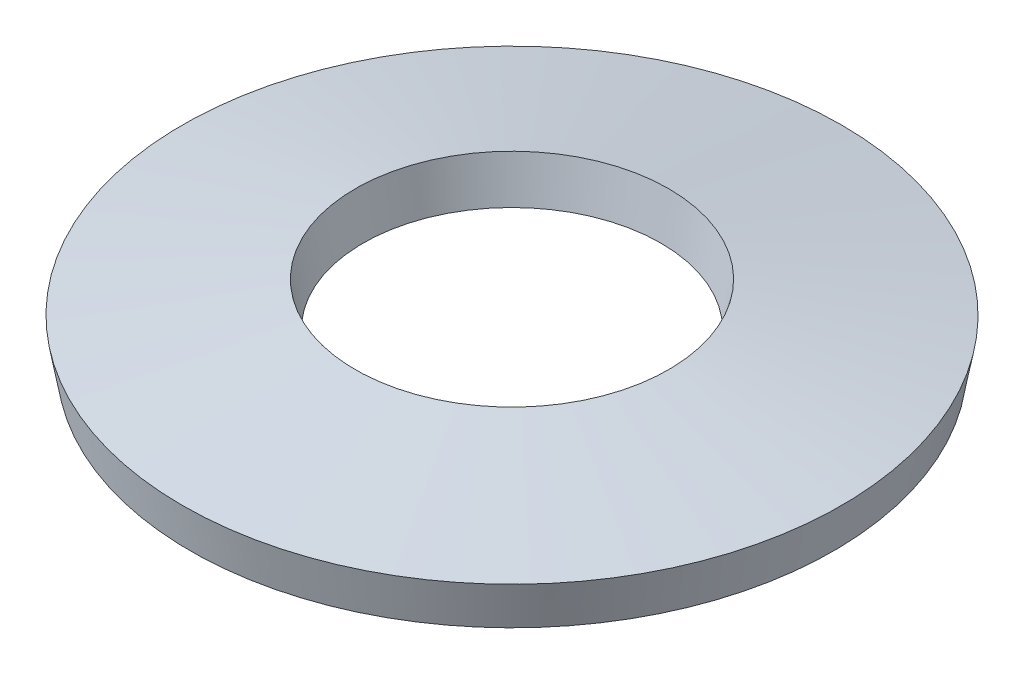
from build123d import *


with BuildPart() as part:
    # Esquisse1 → R_volution1 (revolve)
    with BuildSketch(Plane.XY, mode=Mode.PRIVATE) as r_volution1_sk:
        Polygon((6.419902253, 3.05), (6.1, 1.278655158), (13.180097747, 0), (13.5, 1.771344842), align=None)
    revolve(r_volution1_sk.sketch.rotate(Axis((0, 0, 0), (0, 1, 0)), 90), axis=Axis((0, 0, 0), (0, 1, 0)))


solid = part.part
